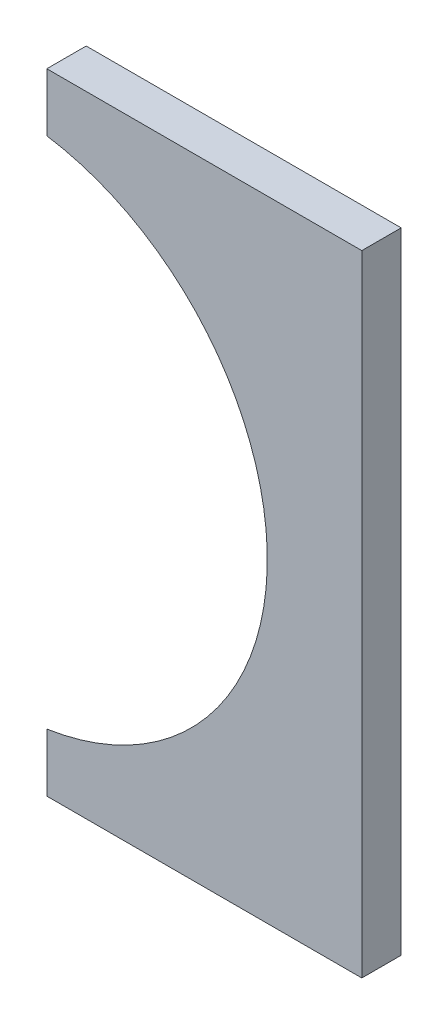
ISO-10303-21;
HEADER;
FILE_DESCRIPTION(('STEP AP214'),'2;1');
FILE_NAME('part.step','',(''),(''),'','','');
FILE_SCHEMA(('AUTOMOTIVE_DESIGN { 1 0 10303 214 1 1 1 1 }'));
ENDSEC;
DATA;
#1=APPLICATION_CONTEXT('core data for automotive mechanical design processes');
#2=APPLICATION_PROTOCOL_DEFINITION('international standard','automotive_design',2000,#1);
#3=PRODUCT_CONTEXT('',#1,'mechanical');
#4=PRODUCT('Part','Part','',(#3));
#5=PRODUCT_RELATED_PRODUCT_CATEGORY('part','',(#4));
#6=PRODUCT_DEFINITION_FORMATION('','',#4);
#7=PRODUCT_DEFINITION_CONTEXT('part definition',#1,'design');
#8=PRODUCT_DEFINITION('design','',#6,#7);
#9=PRODUCT_DEFINITION_SHAPE('','',#8);
#10=(LENGTH_UNIT() NAMED_UNIT(*) SI_UNIT(.MILLI.,.METRE.));
#11=(NAMED_UNIT(*) PLANE_ANGLE_UNIT() SI_UNIT($,.RADIAN.));
#12=(NAMED_UNIT(*) SI_UNIT($,.STERADIAN.) SOLID_ANGLE_UNIT());
#13=UNCERTAINTY_MEASURE_WITH_UNIT(LENGTH_MEASURE(1.E-05),#10,'distance_accuracy_value','');
#14=(GEOMETRIC_REPRESENTATION_CONTEXT(3) GLOBAL_UNCERTAINTY_ASSIGNED_CONTEXT((#13)) GLOBAL_UNIT_ASSIGNED_CONTEXT((#10,
#11,#12)) REPRESENTATION_CONTEXT('',''));
#15=CARTESIAN_POINT('',(0.,0.,0.));
#16=DIRECTION('',(0.,0.,1.));
#17=DIRECTION('',(1.,0.,0.));
#18=AXIS2_PLACEMENT_3D('',#15,#16,#17);
#19=CARTESIAN_POINT('',(4.99999999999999,0.,5.));
#20=DIRECTION('',(-1.,0.,0.));
#21=DIRECTION('',(0.,0.,1.));
#22=AXIS2_PLACEMENT_3D('',#19,#20,#21);
#23=PLANE('',#22);
#24=DIRECTION('',(0.,1.,0.));
#25=VECTOR('',#24,1.);
#26=CARTESIAN_POINT('',(4.99999999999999,0.,5.));
#27=LINE('',#26,#25);
#28=CARTESIAN_POINT('',(4.99999999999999,-40.,5.));
#29=VERTEX_POINT('',#28);
#30=CARTESIAN_POINT('',(4.99999999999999,-32.6190128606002,5.));
#31=VERTEX_POINT('',#30);
#32=EDGE_CURVE('E105',#29,#31,#27,.T.);
#33=ORIENTED_EDGE('',*,*,#32,.T.);
#34=CARTESIAN_POINT('',(4.99999999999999,-32.6190128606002,5.00000000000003));
#35=CARTESIAN_POINT('',(4.99999999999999,-33.0402172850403,4.58365747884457));
#36=CARTESIAN_POINT('',(4.99999999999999,-33.4613300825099,4.16722227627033));
#37=CARTESIAN_POINT('',(4.99999999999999,-34.3033899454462,3.33418445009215));
#38=CARTESIAN_POINT('',(4.99999999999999,-34.7243370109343,2.91758182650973));
#39=CARTESIAN_POINT('',(4.99999999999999,-35.5660830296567,2.08422700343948));
#40=CARTESIAN_POINT('',(4.99999999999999,-35.9868819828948,1.66747480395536));
#41=CARTESIAN_POINT('',(4.99999999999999,-36.8283460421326,0.833835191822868));
#42=CARTESIAN_POINT('',(4.99999999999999,-37.2490111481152,0.416947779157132));
#43=CARTESIAN_POINT('',(4.99999999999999,-37.6696164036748,0.));
#44=B_SPLINE_CURVE_WITH_KNOTS('',3,(#34,#35,#36,#37,#38,#39,#40,#41,#42,#43),.UNSPECIFIED.,.F.,
.F.,(4,2,2,2,4),(0.,1.77673527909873,3.55347032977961,5.33020533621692,7.10694057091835),.UNSPECIFIED.);
#45=CARTESIAN_POINT('',(4.99999999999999,-37.6696164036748,0.));
#46=VERTEX_POINT('',#45);
#47=EDGE_CURVE('E11',#31,#46,#44,.T.);
#48=ORIENTED_EDGE('',*,*,#47,.T.);
#49=DIRECTION('',(0.,1.,0.));
#50=VECTOR('',#49,1.);
#51=CARTESIAN_POINT('',(4.99999999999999,0.,0.));
#52=LINE('',#51,#50);
#53=CARTESIAN_POINT('',(4.99999999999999,-40.,0.));
#54=VERTEX_POINT('',#53);
#55=EDGE_CURVE('E155',#54,#46,#52,.T.);
#56=ORIENTED_EDGE('',*,*,#55,.F.);
#57=DIRECTION('',(0.,0.,-1.));
#58=VECTOR('',#57,1.);
#59=CARTESIAN_POINT('',(4.99999999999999,-40.,5.));
#60=LINE('',#59,#58);
#61=EDGE_CURVE('E111',#29,#54,#60,.T.);
#62=ORIENTED_EDGE('',*,*,#61,.F.);
#63=EDGE_LOOP('',(#33,#48,#56,#62));
#64=FACE_BOUND('',#63,.T.);
#65=ADVANCED_FACE('F43',(#64),#23,.T.);
#66=CARTESIAN_POINT('',(0.,-40.,5.));
#67=DIRECTION('',(0.,1.,0.));
#68=DIRECTION('',(-1.,0.,0.));
#69=AXIS2_PLACEMENT_3D('',#66,#67,#68);
#70=PLANE('',#69);
#71=DIRECTION('',(1.,0.,0.));
#72=VECTOR('',#71,1.);
#73=CARTESIAN_POINT('',(0.,-40.,0.));
#74=LINE('',#73,#72);
#75=CARTESIAN_POINT('',(45.,-40.,0.));
#76=VERTEX_POINT('',#75);
#77=EDGE_CURVE('E150',#54,#76,#74,.T.);
#78=ORIENTED_EDGE('',*,*,#77,.T.);
#79=DIRECTION('',(0.,0.,-1.));
#80=VECTOR('',#79,1.);
#81=CARTESIAN_POINT('',(45.,-40.,5.));
#82=LINE('',#81,#80);
#83=CARTESIAN_POINT('',(45.,-40.,5.));
#84=VERTEX_POINT('',#83);
#85=EDGE_CURVE('E119',#84,#76,#82,.T.);
#86=ORIENTED_EDGE('',*,*,#85,.F.);
#87=DIRECTION('',(1.,0.,0.));
#88=VECTOR('',#87,1.);
#89=CARTESIAN_POINT('',(0.,-40.,5.));
#90=LINE('',#89,#88);
#91=EDGE_CURVE('E113',#29,#84,#90,.T.);
#92=ORIENTED_EDGE('',*,*,#91,.F.);
#93=ORIENTED_EDGE('',*,*,#61,.T.);
#94=EDGE_LOOP('',(#78,#86,#92,#93));
#95=FACE_BOUND('',#94,.T.);
#96=ADVANCED_FACE('F141',(#95),#70,.F.);
#97=CARTESIAN_POINT('',(45.,0.,5.));
#98=DIRECTION('',(-1.,0.,0.));
#99=DIRECTION('',(0.,0.,1.));
#100=AXIS2_PLACEMENT_3D('',#97,#98,#99);
#101=PLANE('',#100);
#102=DIRECTION('',(0.,1.,0.));
#103=VECTOR('',#102,1.);
#104=CARTESIAN_POINT('',(45.,0.,0.));
#105=LINE('',#104,#103);
#106=CARTESIAN_POINT('',(45.,40.,0.));
#107=VERTEX_POINT('',#106);
#108=EDGE_CURVE('E154',#76,#107,#105,.T.);
#109=ORIENTED_EDGE('',*,*,#108,.T.);
#110=DIRECTION('',(0.,0.,-1.));
#111=VECTOR('',#110,1.);
#112=CARTESIAN_POINT('',(45.,40.,5.));
#113=LINE('',#112,#111);
#114=CARTESIAN_POINT('',(45.,40.,5.));
#115=VERTEX_POINT('',#114);
#116=EDGE_CURVE('E161',#115,#107,#113,.T.);
#117=ORIENTED_EDGE('',*,*,#116,.F.);
#118=DIRECTION('',(0.,1.,0.));
#119=VECTOR('',#118,1.);
#120=CARTESIAN_POINT('',(45.,0.,5.));
#121=LINE('',#120,#119);
#122=EDGE_CURVE('E160',#84,#115,#121,.T.);
#123=ORIENTED_EDGE('',*,*,#122,.F.);
#124=ORIENTED_EDGE('',*,*,#85,.T.);
#125=EDGE_LOOP('',(#109,#117,#123,#124));
#126=FACE_BOUND('',#125,.T.);
#127=ADVANCED_FACE('F138',(#126),#101,.F.);
#128=CARTESIAN_POINT('',(0.,40.,5.));
#129=DIRECTION('',(0.,1.,0.));
#130=DIRECTION('',(0.,0.,1.));
#131=AXIS2_PLACEMENT_3D('',#128,#129,#130);
#132=PLANE('',#131);
#133=DIRECTION('',(1.,0.,0.));
#134=VECTOR('',#133,1.);
#135=CARTESIAN_POINT('',(0.,40.,0.));
#136=LINE('',#135,#134);
#137=CARTESIAN_POINT('',(4.99999999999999,40.,0.));
#138=VERTEX_POINT('',#137);
#139=EDGE_CURVE('E163',#138,#107,#136,.T.);
#140=ORIENTED_EDGE('',*,*,#139,.F.);
#141=DIRECTION('',(0.,0.,-1.));
#142=VECTOR('',#141,1.);
#143=CARTESIAN_POINT('',(4.99999999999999,40.,5.));
#144=LINE('',#143,#142);
#145=CARTESIAN_POINT('',(4.99999999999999,40.,5.));
#146=VERTEX_POINT('',#145);
#147=EDGE_CURVE('E168',#146,#138,#144,.T.);
#148=ORIENTED_EDGE('',*,*,#147,.F.);
#149=DIRECTION('',(1.,0.,0.));
#150=VECTOR('',#149,1.);
#151=CARTESIAN_POINT('',(0.,40.,5.));
#152=LINE('',#151,#150);
#153=EDGE_CURVE('E172',#146,#115,#152,.T.);
#154=ORIENTED_EDGE('',*,*,#153,.T.);
#155=ORIENTED_EDGE('',*,*,#116,.T.);
#156=EDGE_LOOP('',(#140,#148,#154,#155));
#157=FACE_BOUND('',#156,.T.);
#158=ADVANCED_FACE('F131',(#157),#132,.T.);
#159=CARTESIAN_POINT('',(4.99999999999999,37.6696164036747,0.));
#160=VERTEX_POINT('',#159);
#161=EDGE_CURVE('E109',#160,#138,#52,.T.);
#162=ORIENTED_EDGE('',*,*,#161,.F.);
#163=CARTESIAN_POINT('',(4.99999999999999,37.6696164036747,0.));
#164=CARTESIAN_POINT('',(4.99999999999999,37.2490111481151,0.416947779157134));
#165=CARTESIAN_POINT('',(4.99999999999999,36.8283460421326,0.833835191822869));
#166=CARTESIAN_POINT('',(4.99999999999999,35.9868819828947,1.66747480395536));
#167=CARTESIAN_POINT('',(4.99999999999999,35.5660830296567,2.08422700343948));
#168=CARTESIAN_POINT('',(4.99999999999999,34.7243370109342,2.91758182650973));
#169=CARTESIAN_POINT('',(4.99999999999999,34.3033899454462,3.33418445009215));
#170=CARTESIAN_POINT('',(4.99999999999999,33.4613300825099,4.16722227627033));
#171=CARTESIAN_POINT('',(4.99999999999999,33.0402172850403,4.58365747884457));
#172=CARTESIAN_POINT('',(4.99999999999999,32.6190128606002,5.00000000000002));
#173=B_SPLINE_CURVE_WITH_KNOTS('',3,(#163,#164,#165,#166,#167,#168,#169,#170,#171,#172),
.UNSPECIFIED.,.F.,.F.,(4,2,2,2,4),(0.,1.77673523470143,3.55347024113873,5.33020529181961,
7.10694057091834),.UNSPECIFIED.);
#174=CARTESIAN_POINT('',(4.99999999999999,32.6190128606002,5.));
#175=VERTEX_POINT('',#174);
#176=EDGE_CURVE('E58',#160,#175,#173,.T.);
#177=ORIENTED_EDGE('',*,*,#176,.T.);
#178=EDGE_CURVE('E108',#175,#146,#27,.T.);
#179=ORIENTED_EDGE('',*,*,#178,.T.);
#180=ORIENTED_EDGE('',*,*,#147,.T.);
#181=EDGE_LOOP('',(#162,#177,#179,#180));
#182=FACE_BOUND('',#181,.T.);
#183=ADVANCED_FACE('F126',(#182),#23,.T.);
#184=CARTESIAN_POINT('',(0.,0.,5.));
#185=DIRECTION('',(0.,0.,1.));
#186=DIRECTION('',(1.,0.,0.));
#187=AXIS2_PLACEMENT_3D('',#184,#185,#186);
#188=PLANE('',#187);
#189=CARTESIAN_POINT('',(0.,0.,5.));
#190=DIRECTION('',(0.,0.,1.));
#191=DIRECTION('',(1.,0.,0.));
#192=AXIS2_PLACEMENT_3D('',#189,#190,#191);
#193=CIRCLE('',#192,33.);
#194=EDGE_CURVE('E103',#31,#175,#193,.T.);
#195=ORIENTED_EDGE('',*,*,#194,.F.);
#196=ORIENTED_EDGE('',*,*,#32,.F.);
#197=ORIENTED_EDGE('',*,*,#91,.T.);
#198=ORIENTED_EDGE('',*,*,#122,.T.);
#199=ORIENTED_EDGE('',*,*,#153,.F.);
#200=ORIENTED_EDGE('',*,*,#178,.F.);
#201=EDGE_LOOP('',(#195,#196,#197,#198,#199,#200));
#202=FACE_BOUND('',#201,.T.);
#203=ADVANCED_FACE('F104',(#202),#188,.T.);
#204=CARTESIAN_POINT('',(0.,0.,0.));
#205=DIRECTION('',(0.,0.,1.));
#206=DIRECTION('',(1.,0.,0.));
#207=AXIS2_PLACEMENT_3D('',#204,#205,#206);
#208=PLANE('',#207);
#209=ORIENTED_EDGE('',*,*,#55,.T.);
#210=CARTESIAN_POINT('',(0.,0.,0.));
#211=DIRECTION('',(0.,0.,1.));
#212=DIRECTION('',(1.,0.,0.));
#213=AXIS2_PLACEMENT_3D('',#210,#211,#212);
#214=CIRCLE('',#213,38.);
#215=EDGE_CURVE('E115',#46,#160,#214,.T.);
#216=ORIENTED_EDGE('',*,*,#215,.T.);
#217=ORIENTED_EDGE('',*,*,#161,.T.);
#218=ORIENTED_EDGE('',*,*,#139,.T.);
#219=ORIENTED_EDGE('',*,*,#108,.F.);
#220=ORIENTED_EDGE('',*,*,#77,.F.);
#221=EDGE_LOOP('',(#209,#216,#217,#218,#219,#220));
#222=FACE_BOUND('',#221,.T.);
#223=ADVANCED_FACE('F133',(#222),#208,.F.);
#224=CARTESIAN_POINT('',(0.,0.,0.));
#225=DIRECTION('',(0.,0.,-1.));
#226=DIRECTION('',(-1.,0.,0.));
#227=AXIS2_PLACEMENT_3D('',#224,#225,#226);
#228=CONICAL_SURFACE('',#227,38.,0.785398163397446);
#229=ORIENTED_EDGE('',*,*,#47,.F.);
#230=ORIENTED_EDGE('',*,*,#194,.T.);
#231=ORIENTED_EDGE('',*,*,#176,.F.);
#232=ORIENTED_EDGE('',*,*,#215,.F.);
#233=EDGE_LOOP('',(#229,#230,#231,#232));
#234=FACE_BOUND('',#233,.T.);
#235=ADVANCED_FACE('F46',(#234),#228,.F.);
#236=CLOSED_SHELL('',(#65,#96,#127,#158,#183,#203,#223,#235));
#237=MANIFOLD_SOLID_BREP('B2',#236);
#238=ADVANCED_BREP_SHAPE_REPRESENTATION('',(#18,#237),#14);
#239=SHAPE_DEFINITION_REPRESENTATION(#9,#238);
ENDSEC;
END-ISO-10303-21;
